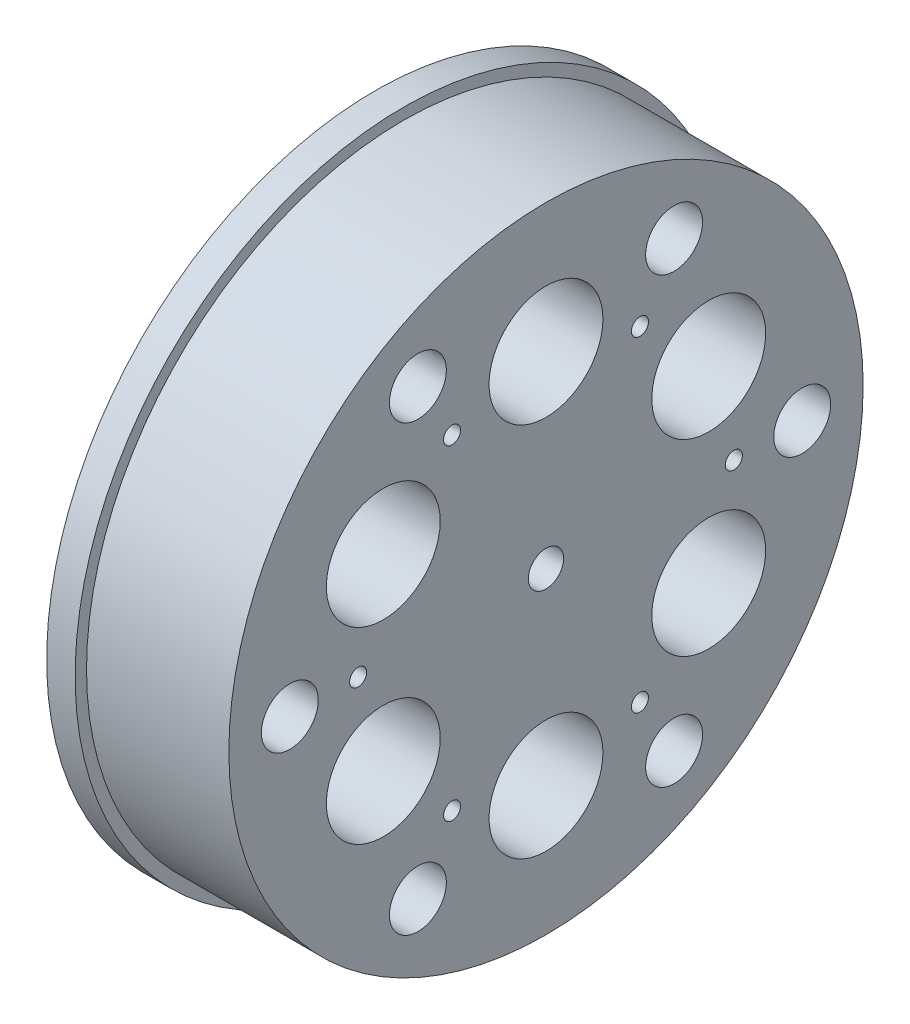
ISO-10303-21;
HEADER;
FILE_DESCRIPTION(('STEP AP214'),'2;1');
FILE_NAME('part.step','',(''),(''),'','','');
FILE_SCHEMA(('AUTOMOTIVE_DESIGN { 1 0 10303 214 1 1 1 1 }'));
ENDSEC;
DATA;
#1=APPLICATION_CONTEXT('core data for automotive mechanical design processes');
#2=APPLICATION_PROTOCOL_DEFINITION('international standard','automotive_design',2000,#1);
#3=PRODUCT_CONTEXT('',#1,'mechanical');
#4=PRODUCT('Part','Part','',(#3));
#5=PRODUCT_RELATED_PRODUCT_CATEGORY('part','',(#4));
#6=PRODUCT_DEFINITION_FORMATION('','',#4);
#7=PRODUCT_DEFINITION_CONTEXT('part definition',#1,'design');
#8=PRODUCT_DEFINITION('design','',#6,#7);
#9=PRODUCT_DEFINITION_SHAPE('','',#8);
#10=(LENGTH_UNIT() NAMED_UNIT(*) SI_UNIT(.MILLI.,.METRE.));
#11=(NAMED_UNIT(*) PLANE_ANGLE_UNIT() SI_UNIT($,.RADIAN.));
#12=(NAMED_UNIT(*) SI_UNIT($,.STERADIAN.) SOLID_ANGLE_UNIT());
#13=UNCERTAINTY_MEASURE_WITH_UNIT(LENGTH_MEASURE(1.E-05),#10,'distance_accuracy_value','');
#14=(GEOMETRIC_REPRESENTATION_CONTEXT(3) GLOBAL_UNCERTAINTY_ASSIGNED_CONTEXT((#13)) GLOBAL_UNIT_ASSIGNED_CONTEXT((#10,
#11,#12)) REPRESENTATION_CONTEXT('',''));
#15=CARTESIAN_POINT('',(0.,0.,0.));
#16=DIRECTION('',(0.,0.,1.));
#17=DIRECTION('',(1.,0.,0.));
#18=AXIS2_PLACEMENT_3D('',#15,#16,#17);
#19=CARTESIAN_POINT('',(30.,0.,0.));
#20=DIRECTION('',(1.,0.,0.));
#21=DIRECTION('',(0.,0.,-1.));
#22=AXIS2_PLACEMENT_3D('',#19,#20,#21);
#23=PLANE('',#22);
#24=CARTESIAN_POINT('',(30.,28.5788383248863,-16.5000000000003));
#25=DIRECTION('',(1.,0.,0.));
#26=DIRECTION('',(0.,0.,-1.));
#27=AXIS2_PLACEMENT_3D('',#24,#25,#26);
#28=CIRCLE('',#27,1.50000000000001);
#29=CARTESIAN_POINT('',(30.,28.5788383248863,-18.0000000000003));
#30=VERTEX_POINT('',#29);
#31=EDGE_CURVE('E154',#30,#30,#28,.T.);
#32=ORIENTED_EDGE('',*,*,#31,.F.);
#33=EDGE_LOOP('',(#32));
#34=FACE_BOUND('',#33,.T.);
#35=CARTESIAN_POINT('',(30.,28.5788383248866,16.4999999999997));
#36=DIRECTION('',(1.,0.,0.));
#37=DIRECTION('',(0.,0.,-1.));
#38=AXIS2_PLACEMENT_3D('',#35,#36,#37);
#39=CIRCLE('',#38,1.5);
#40=CARTESIAN_POINT('',(30.,28.5788383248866,14.9999999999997));
#41=VERTEX_POINT('',#40);
#42=EDGE_CURVE('E142',#41,#41,#39,.T.);
#43=ORIENTED_EDGE('',*,*,#42,.F.);
#44=EDGE_LOOP('',(#43));
#45=FACE_BOUND('',#44,.T.);
#46=CARTESIAN_POINT('',(30.,2.41717601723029E-13,33.));
#47=DIRECTION('',(1.,0.,0.));
#48=DIRECTION('',(0.,0.,-1.));
#49=AXIS2_PLACEMENT_3D('',#46,#47,#48);
#50=CIRCLE('',#49,1.5);
#51=CARTESIAN_POINT('',(30.,2.41717601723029E-13,31.5));
#52=VERTEX_POINT('',#51);
#53=EDGE_CURVE('E130',#52,#52,#50,.T.);
#54=ORIENTED_EDGE('',*,*,#53,.F.);
#55=EDGE_LOOP('',(#54));
#56=FACE_BOUND('',#55,.T.);
#57=CARTESIAN_POINT('',(30.,-28.5788383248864,16.5000000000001));
#58=DIRECTION('',(1.,0.,0.));
#59=DIRECTION('',(0.,0.,-1.));
#60=AXIS2_PLACEMENT_3D('',#57,#58,#59);
#61=CIRCLE('',#60,1.50000000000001);
#62=CARTESIAN_POINT('',(30.,-28.5788383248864,15.0000000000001));
#63=VERTEX_POINT('',#62);
#64=EDGE_CURVE('E118',#63,#63,#61,.T.);
#65=ORIENTED_EDGE('',*,*,#64,.F.);
#66=EDGE_LOOP('',(#65));
#67=FACE_BOUND('',#66,.T.);
#68=CARTESIAN_POINT('',(30.,-28.5788383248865,-16.4999999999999));
#69=DIRECTION('',(1.,0.,0.));
#70=DIRECTION('',(0.,0.,-1.));
#71=AXIS2_PLACEMENT_3D('',#68,#69,#70);
#72=CIRCLE('',#71,1.5);
#73=CARTESIAN_POINT('',(30.,-28.5788383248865,-17.9999999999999));
#74=VERTEX_POINT('',#73);
#75=EDGE_CURVE('E106',#74,#74,#72,.T.);
#76=ORIENTED_EDGE('',*,*,#75,.F.);
#77=EDGE_LOOP('',(#76));
#78=FACE_BOUND('',#77,.T.);
#79=CARTESIAN_POINT('',(30.,38.9711431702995,-22.5000000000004));
#80=DIRECTION('',(1.,0.,0.));
#81=DIRECTION('',(0.,0.,-1.));
#82=AXIS2_PLACEMENT_3D('',#79,#80,#81);
#83=CIRCLE('',#82,5.);
#84=CARTESIAN_POINT('',(30.,38.9711431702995,-27.5000000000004));
#85=VERTEX_POINT('',#84);
#86=EDGE_CURVE('E94',#85,#85,#83,.T.);
#87=ORIENTED_EDGE('',*,*,#86,.F.);
#88=EDGE_LOOP('',(#87));
#89=FACE_BOUND('',#88,.T.);
#90=CARTESIAN_POINT('',(30.,3.14233502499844E-13,45.));
#91=DIRECTION('',(1.,0.,0.));
#92=DIRECTION('',(0.,0.,-1.));
#93=AXIS2_PLACEMENT_3D('',#90,#91,#92);
#94=CIRCLE('',#93,5.);
#95=CARTESIAN_POINT('',(30.,3.14233502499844E-13,40.));
#96=VERTEX_POINT('',#95);
#97=EDGE_CURVE('E82',#96,#96,#94,.T.);
#98=ORIENTED_EDGE('',*,*,#97,.F.);
#99=EDGE_LOOP('',(#98));
#100=FACE_BOUND('',#99,.T.);
#101=CARTESIAN_POINT('',(30.,0.,-33.));
#102=DIRECTION('',(1.,0.,0.));
#103=DIRECTION('',(0.,0.,-1.));
#104=AXIS2_PLACEMENT_3D('',#101,#102,#103);
#105=CIRCLE('',#104,1.5);
#106=CARTESIAN_POINT('',(30.,0.,-34.5));
#107=VERTEX_POINT('',#106);
#108=EDGE_CURVE('E70',#107,#107,#105,.T.);
#109=ORIENTED_EDGE('',*,*,#108,.F.);
#110=EDGE_LOOP('',(#109));
#111=FACE_BOUND('',#110,.T.);
#112=CARTESIAN_POINT('',(30.,0.,-45.));
#113=DIRECTION('',(1.,0.,0.));
#114=DIRECTION('',(0.,0.,-1.));
#115=AXIS2_PLACEMENT_3D('',#112,#113,#114);
#116=CIRCLE('',#115,5.);
#117=CARTESIAN_POINT('',(30.,0.,-50.));
#118=VERTEX_POINT('',#117);
#119=EDGE_CURVE('E58',#118,#118,#116,.T.);
#120=ORIENTED_EDGE('',*,*,#119,.F.);
#121=EDGE_LOOP('',(#120));
#122=FACE_BOUND('',#121,.T.);
#123=CARTESIAN_POINT('',(30.,33.,0.));
#124=DIRECTION('',(1.,0.,0.));
#125=DIRECTION('',(0.,0.,-1.));
#126=AXIS2_PLACEMENT_3D('',#123,#124,#125);
#127=CIRCLE('',#126,10.);
#128=CARTESIAN_POINT('',(30.,33.,-10.));
#129=VERTEX_POINT('',#128);
#130=EDGE_CURVE('E45',#129,#129,#127,.T.);
#131=ORIENTED_EDGE('',*,*,#130,.F.);
#132=EDGE_LOOP('',(#131));
#133=FACE_BOUND('',#132,.T.);
#134=CARTESIAN_POINT('',(30.,0.,0.));
#135=DIRECTION('',(1.,0.,0.));
#136=DIRECTION('',(0.,0.,-1.));
#137=AXIS2_PLACEMENT_3D('',#134,#135,#136);
#138=CIRCLE('',#137,3.1);
#139=CARTESIAN_POINT('',(30.,0.,-3.1));
#140=VERTEX_POINT('',#139);
#141=EDGE_CURVE('E53',#140,#140,#138,.T.);
#142=ORIENTED_EDGE('',*,*,#141,.F.);
#143=EDGE_LOOP('',(#142));
#144=FACE_BOUND('',#143,.T.);
#145=CARTESIAN_POINT('',(30.,-38.9711431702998,-22.4999999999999));
#146=DIRECTION('',(1.,0.,0.));
#147=DIRECTION('',(0.,0.,-1.));
#148=AXIS2_PLACEMENT_3D('',#145,#146,#147);
#149=CIRCLE('',#148,5.);
#150=CARTESIAN_POINT('',(30.,-38.9711431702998,-27.4999999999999));
#151=VERTEX_POINT('',#150);
#152=EDGE_CURVE('E64',#151,#151,#149,.T.);
#153=ORIENTED_EDGE('',*,*,#152,.F.);
#154=EDGE_LOOP('',(#153));
#155=FACE_BOUND('',#154,.T.);
#156=CARTESIAN_POINT('',(30.,-38.9711431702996,22.5000000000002));
#157=DIRECTION('',(1.,0.,0.));
#158=DIRECTION('',(0.,0.,-1.));
#159=AXIS2_PLACEMENT_3D('',#156,#157,#158);
#160=CIRCLE('',#159,5.);
#161=CARTESIAN_POINT('',(30.,-38.9711431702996,17.5000000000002));
#162=VERTEX_POINT('',#161);
#163=EDGE_CURVE('E76',#162,#162,#160,.T.);
#164=ORIENTED_EDGE('',*,*,#163,.F.);
#165=EDGE_LOOP('',(#164));
#166=FACE_BOUND('',#165,.T.);
#167=CARTESIAN_POINT('',(30.,38.9711431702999,22.4999999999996));
#168=DIRECTION('',(1.,0.,0.));
#169=DIRECTION('',(0.,0.,-1.));
#170=AXIS2_PLACEMENT_3D('',#167,#168,#169);
#171=CIRCLE('',#170,5.);
#172=CARTESIAN_POINT('',(30.,38.9711431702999,17.4999999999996));
#173=VERTEX_POINT('',#172);
#174=EDGE_CURVE('E88',#173,#173,#171,.T.);
#175=ORIENTED_EDGE('',*,*,#174,.F.);
#176=EDGE_LOOP('',(#175));
#177=FACE_BOUND('',#176,.T.);
#178=CARTESIAN_POINT('',(30.,16.4999999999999,-28.5788383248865));
#179=DIRECTION('',(1.,0.,0.));
#180=DIRECTION('',(0.,0.,-1.));
#181=AXIS2_PLACEMENT_3D('',#178,#179,#180);
#182=CIRCLE('',#181,10.);
#183=CARTESIAN_POINT('',(30.,16.4999999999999,-38.5788383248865));
#184=VERTEX_POINT('',#183);
#185=EDGE_CURVE('E100',#184,#184,#182,.T.);
#186=ORIENTED_EDGE('',*,*,#185,.F.);
#187=EDGE_LOOP('',(#186));
#188=FACE_BOUND('',#187,.T.);
#189=CARTESIAN_POINT('',(30.,-16.5000000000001,-28.5788383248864));
#190=DIRECTION('',(1.,0.,0.));
#191=DIRECTION('',(0.,0.,-1.));
#192=AXIS2_PLACEMENT_3D('',#189,#190,#191);
#193=CIRCLE('',#192,10.);
#194=CARTESIAN_POINT('',(30.,-16.5000000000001,-38.5788383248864));
#195=VERTEX_POINT('',#194);
#196=EDGE_CURVE('E112',#195,#195,#193,.T.);
#197=ORIENTED_EDGE('',*,*,#196,.F.);
#198=EDGE_LOOP('',(#197));
#199=FACE_BOUND('',#198,.T.);
#200=CARTESIAN_POINT('',(30.,-33.,2.30437901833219E-13));
#201=DIRECTION('',(1.,0.,0.));
#202=DIRECTION('',(0.,0.,-1.));
#203=AXIS2_PLACEMENT_3D('',#200,#201,#202);
#204=CIRCLE('',#203,10.);
#205=CARTESIAN_POINT('',(30.,-33.,-9.99999999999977));
#206=VERTEX_POINT('',#205);
#207=EDGE_CURVE('E124',#206,#206,#204,.T.);
#208=ORIENTED_EDGE('',*,*,#207,.F.);
#209=EDGE_LOOP('',(#208));
#210=FACE_BOUND('',#209,.T.);
#211=CARTESIAN_POINT('',(30.,-16.4999999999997,28.5788383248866));
#212=DIRECTION('',(1.,0.,0.));
#213=DIRECTION('',(0.,0.,-1.));
#214=AXIS2_PLACEMENT_3D('',#211,#212,#213);
#215=CIRCLE('',#214,10.);
#216=CARTESIAN_POINT('',(30.,-16.4999999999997,18.5788383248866));
#217=VERTEX_POINT('',#216);
#218=EDGE_CURVE('E136',#217,#217,#215,.T.);
#219=ORIENTED_EDGE('',*,*,#218,.F.);
#220=EDGE_LOOP('',(#219));
#221=FACE_BOUND('',#220,.T.);
#222=CARTESIAN_POINT('',(30.,16.5000000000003,28.5788383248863));
#223=DIRECTION('',(1.,0.,0.));
#224=DIRECTION('',(0.,0.,-1.));
#225=AXIS2_PLACEMENT_3D('',#222,#223,#224);
#226=CIRCLE('',#225,10.);
#227=CARTESIAN_POINT('',(30.,16.5000000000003,18.5788383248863));
#228=VERTEX_POINT('',#227);
#229=EDGE_CURVE('E148',#228,#228,#226,.T.);
#230=ORIENTED_EDGE('',*,*,#229,.F.);
#231=EDGE_LOOP('',(#230));
#232=FACE_BOUND('',#231,.T.);
#233=CARTESIAN_POINT('',(30.,0.,0.));
#234=DIRECTION('',(1.,0.,0.));
#235=DIRECTION('',(0.,0.,-1.));
#236=AXIS2_PLACEMENT_3D('',#233,#234,#235);
#237=CIRCLE('',#236,55.705);
#238=CARTESIAN_POINT('',(30.,0.,-55.705));
#239=VERTEX_POINT('',#238);
#240=EDGE_CURVE('E162',#239,#239,#237,.T.);
#241=ORIENTED_EDGE('',*,*,#240,.T.);
#242=EDGE_LOOP('',(#241));
#243=FACE_BOUND('',#242,.T.);
#244=ADVANCED_FACE('F37',(#34,#45,#56,#67,#78,#89,#100,#111,#122,#133,#144,#155,#166,#177,#188,
#199,#210,#221,#232,#243),#23,.T.);
#245=CARTESIAN_POINT('',(30.,0.,0.));
#246=DIRECTION('',(-1.,0.,0.));
#247=DIRECTION('',(0.,0.,1.));
#248=AXIS2_PLACEMENT_3D('',#245,#246,#247);
#249=CYLINDRICAL_SURFACE('',#248,57.705);
#250=CARTESIAN_POINT('',(0.,0.,0.));
#251=DIRECTION('',(1.,0.,0.));
#252=DIRECTION('',(0.,0.,-1.));
#253=AXIS2_PLACEMENT_3D('',#250,#251,#252);
#254=CIRCLE('',#253,57.705);
#255=CARTESIAN_POINT('',(0.,0.,-57.705));
#256=VERTEX_POINT('',#255);
#257=EDGE_CURVE('E10',#256,#256,#254,.T.);
#258=ORIENTED_EDGE('',*,*,#257,.T.);
#259=EDGE_LOOP('',(#258));
#260=FACE_BOUND('',#259,.T.);
#261=CARTESIAN_POINT('',(5.,0.,0.));
#262=DIRECTION('',(1.,0.,0.));
#263=DIRECTION('',(0.,0.,-1.));
#264=AXIS2_PLACEMENT_3D('',#261,#262,#263);
#265=CIRCLE('',#264,57.705);
#266=CARTESIAN_POINT('',(5.,0.,-57.705));
#267=VERTEX_POINT('',#266);
#268=EDGE_CURVE('E41',#267,#267,#265,.T.);
#269=ORIENTED_EDGE('',*,*,#268,.F.);
#270=EDGE_LOOP('',(#269));
#271=FACE_BOUND('',#270,.T.);
#272=ADVANCED_FACE('F39',(#260,#271),#249,.T.);
#273=CARTESIAN_POINT('',(0.,0.,0.));
#274=DIRECTION('',(1.,0.,0.));
#275=DIRECTION('',(0.,0.,-1.));
#276=AXIS2_PLACEMENT_3D('',#273,#274,#275);
#277=PLANE('',#276);
#278=CARTESIAN_POINT('',(0.,16.5000000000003,28.5788383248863));
#279=DIRECTION('',(1.,0.,0.));
#280=DIRECTION('',(0.,0.,-1.));
#281=AXIS2_PLACEMENT_3D('',#278,#279,#280);
#282=CIRCLE('',#281,10.);
#283=CARTESIAN_POINT('',(0.,16.5000000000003,18.5788383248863));
#284=VERTEX_POINT('',#283);
#285=EDGE_CURVE('E151',#284,#284,#282,.T.);
#286=ORIENTED_EDGE('',*,*,#285,.T.);
#287=EDGE_LOOP('',(#286));
#288=FACE_BOUND('',#287,.T.);
#289=CARTESIAN_POINT('',(0.,-16.4999999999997,28.5788383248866));
#290=DIRECTION('',(1.,0.,0.));
#291=DIRECTION('',(0.,0.,-1.));
#292=AXIS2_PLACEMENT_3D('',#289,#290,#291);
#293=CIRCLE('',#292,10.);
#294=CARTESIAN_POINT('',(0.,-16.4999999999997,18.5788383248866));
#295=VERTEX_POINT('',#294);
#296=EDGE_CURVE('E139',#295,#295,#293,.T.);
#297=ORIENTED_EDGE('',*,*,#296,.T.);
#298=EDGE_LOOP('',(#297));
#299=FACE_BOUND('',#298,.T.);
#300=CARTESIAN_POINT('',(0.,-33.,2.30437901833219E-13));
#301=DIRECTION('',(1.,0.,0.));
#302=DIRECTION('',(0.,0.,-1.));
#303=AXIS2_PLACEMENT_3D('',#300,#301,#302);
#304=CIRCLE('',#303,10.);
#305=CARTESIAN_POINT('',(0.,-33.,-9.99999999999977));
#306=VERTEX_POINT('',#305);
#307=EDGE_CURVE('E127',#306,#306,#304,.T.);
#308=ORIENTED_EDGE('',*,*,#307,.T.);
#309=EDGE_LOOP('',(#308));
#310=FACE_BOUND('',#309,.T.);
#311=CARTESIAN_POINT('',(0.,-16.5000000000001,-28.5788383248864));
#312=DIRECTION('',(1.,0.,0.));
#313=DIRECTION('',(0.,0.,-1.));
#314=AXIS2_PLACEMENT_3D('',#311,#312,#313);
#315=CIRCLE('',#314,10.);
#316=CARTESIAN_POINT('',(0.,-16.5000000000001,-38.5788383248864));
#317=VERTEX_POINT('',#316);
#318=EDGE_CURVE('E115',#317,#317,#315,.T.);
#319=ORIENTED_EDGE('',*,*,#318,.T.);
#320=EDGE_LOOP('',(#319));
#321=FACE_BOUND('',#320,.T.);
#322=CARTESIAN_POINT('',(0.,16.4999999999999,-28.5788383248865));
#323=DIRECTION('',(1.,0.,0.));
#324=DIRECTION('',(0.,0.,-1.));
#325=AXIS2_PLACEMENT_3D('',#322,#323,#324);
#326=CIRCLE('',#325,10.);
#327=CARTESIAN_POINT('',(0.,16.4999999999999,-38.5788383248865));
#328=VERTEX_POINT('',#327);
#329=EDGE_CURVE('E103',#328,#328,#326,.T.);
#330=ORIENTED_EDGE('',*,*,#329,.T.);
#331=EDGE_LOOP('',(#330));
#332=FACE_BOUND('',#331,.T.);
#333=CARTESIAN_POINT('',(0.,38.9711431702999,22.4999999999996));
#334=DIRECTION('',(1.,0.,0.));
#335=DIRECTION('',(0.,0.,-1.));
#336=AXIS2_PLACEMENT_3D('',#333,#334,#335);
#337=CIRCLE('',#336,5.);
#338=CARTESIAN_POINT('',(0.,38.9711431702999,17.4999999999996));
#339=VERTEX_POINT('',#338);
#340=EDGE_CURVE('E91',#339,#339,#337,.T.);
#341=ORIENTED_EDGE('',*,*,#340,.T.);
#342=EDGE_LOOP('',(#341));
#343=FACE_BOUND('',#342,.T.);
#344=CARTESIAN_POINT('',(0.,-38.9711431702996,22.5000000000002));
#345=DIRECTION('',(1.,0.,0.));
#346=DIRECTION('',(0.,0.,-1.));
#347=AXIS2_PLACEMENT_3D('',#344,#345,#346);
#348=CIRCLE('',#347,5.);
#349=CARTESIAN_POINT('',(0.,-38.9711431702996,17.5000000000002));
#350=VERTEX_POINT('',#349);
#351=EDGE_CURVE('E79',#350,#350,#348,.T.);
#352=ORIENTED_EDGE('',*,*,#351,.T.);
#353=EDGE_LOOP('',(#352));
#354=FACE_BOUND('',#353,.T.);
#355=CARTESIAN_POINT('',(0.,-38.9711431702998,-22.4999999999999));
#356=DIRECTION('',(1.,0.,0.));
#357=DIRECTION('',(0.,0.,-1.));
#358=AXIS2_PLACEMENT_3D('',#355,#356,#357);
#359=CIRCLE('',#358,5.);
#360=CARTESIAN_POINT('',(0.,-38.9711431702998,-27.4999999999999));
#361=VERTEX_POINT('',#360);
#362=EDGE_CURVE('E67',#361,#361,#359,.T.);
#363=ORIENTED_EDGE('',*,*,#362,.T.);
#364=EDGE_LOOP('',(#363));
#365=FACE_BOUND('',#364,.T.);
#366=CARTESIAN_POINT('',(0.,0.,0.));
#367=DIRECTION('',(1.,0.,0.));
#368=DIRECTION('',(0.,0.,-1.));
#369=AXIS2_PLACEMENT_3D('',#366,#367,#368);
#370=CIRCLE('',#369,3.1);
#371=CARTESIAN_POINT('',(0.,0.,-3.1));
#372=VERTEX_POINT('',#371);
#373=EDGE_CURVE('E55',#372,#372,#370,.T.);
#374=ORIENTED_EDGE('',*,*,#373,.T.);
#375=EDGE_LOOP('',(#374));
#376=FACE_BOUND('',#375,.T.);
#377=ORIENTED_EDGE('',*,*,#257,.F.);
#378=EDGE_LOOP('',(#377));
#379=FACE_BOUND('',#378,.T.);
#380=CARTESIAN_POINT('',(0.,33.,0.));
#381=DIRECTION('',(1.,0.,0.));
#382=DIRECTION('',(0.,0.,-1.));
#383=AXIS2_PLACEMENT_3D('',#380,#381,#382);
#384=CIRCLE('',#383,10.);
#385=CARTESIAN_POINT('',(0.,33.,-10.));
#386=VERTEX_POINT('',#385);
#387=EDGE_CURVE('E49',#386,#386,#384,.T.);
#388=ORIENTED_EDGE('',*,*,#387,.T.);
#389=EDGE_LOOP('',(#388));
#390=FACE_BOUND('',#389,.T.);
#391=CARTESIAN_POINT('',(0.,0.,-45.));
#392=DIRECTION('',(1.,0.,0.));
#393=DIRECTION('',(0.,0.,-1.));
#394=AXIS2_PLACEMENT_3D('',#391,#392,#393);
#395=CIRCLE('',#394,5.);
#396=CARTESIAN_POINT('',(0.,0.,-50.));
#397=VERTEX_POINT('',#396);
#398=EDGE_CURVE('E61',#397,#397,#395,.T.);
#399=ORIENTED_EDGE('',*,*,#398,.T.);
#400=EDGE_LOOP('',(#399));
#401=FACE_BOUND('',#400,.T.);
#402=CARTESIAN_POINT('',(0.,0.,-33.));
#403=DIRECTION('',(1.,0.,0.));
#404=DIRECTION('',(0.,0.,-1.));
#405=AXIS2_PLACEMENT_3D('',#402,#403,#404);
#406=CIRCLE('',#405,1.5);
#407=CARTESIAN_POINT('',(0.,0.,-34.5));
#408=VERTEX_POINT('',#407);
#409=EDGE_CURVE('E73',#408,#408,#406,.T.);
#410=ORIENTED_EDGE('',*,*,#409,.T.);
#411=EDGE_LOOP('',(#410));
#412=FACE_BOUND('',#411,.T.);
#413=CARTESIAN_POINT('',(0.,3.14233502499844E-13,45.));
#414=DIRECTION('',(1.,0.,0.));
#415=DIRECTION('',(0.,0.,-1.));
#416=AXIS2_PLACEMENT_3D('',#413,#414,#415);
#417=CIRCLE('',#416,5.);
#418=CARTESIAN_POINT('',(0.,3.14233502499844E-13,40.));
#419=VERTEX_POINT('',#418);
#420=EDGE_CURVE('E85',#419,#419,#417,.T.);
#421=ORIENTED_EDGE('',*,*,#420,.T.);
#422=EDGE_LOOP('',(#421));
#423=FACE_BOUND('',#422,.T.);
#424=CARTESIAN_POINT('',(0.,38.9711431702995,-22.5000000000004));
#425=DIRECTION('',(1.,0.,0.));
#426=DIRECTION('',(0.,0.,-1.));
#427=AXIS2_PLACEMENT_3D('',#424,#425,#426);
#428=CIRCLE('',#427,5.);
#429=CARTESIAN_POINT('',(0.,38.9711431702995,-27.5000000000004));
#430=VERTEX_POINT('',#429);
#431=EDGE_CURVE('E97',#430,#430,#428,.T.);
#432=ORIENTED_EDGE('',*,*,#431,.T.);
#433=EDGE_LOOP('',(#432));
#434=FACE_BOUND('',#433,.T.);
#435=CARTESIAN_POINT('',(0.,-28.5788383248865,-16.4999999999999));
#436=DIRECTION('',(1.,0.,0.));
#437=DIRECTION('',(0.,0.,-1.));
#438=AXIS2_PLACEMENT_3D('',#435,#436,#437);
#439=CIRCLE('',#438,1.5);
#440=CARTESIAN_POINT('',(0.,-28.5788383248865,-17.9999999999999));
#441=VERTEX_POINT('',#440);
#442=EDGE_CURVE('E109',#441,#441,#439,.T.);
#443=ORIENTED_EDGE('',*,*,#442,.T.);
#444=EDGE_LOOP('',(#443));
#445=FACE_BOUND('',#444,.T.);
#446=CARTESIAN_POINT('',(0.,-28.5788383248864,16.5000000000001));
#447=DIRECTION('',(1.,0.,0.));
#448=DIRECTION('',(0.,0.,-1.));
#449=AXIS2_PLACEMENT_3D('',#446,#447,#448);
#450=CIRCLE('',#449,1.50000000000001);
#451=CARTESIAN_POINT('',(0.,-28.5788383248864,15.0000000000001));
#452=VERTEX_POINT('',#451);
#453=EDGE_CURVE('E121',#452,#452,#450,.T.);
#454=ORIENTED_EDGE('',*,*,#453,.T.);
#455=EDGE_LOOP('',(#454));
#456=FACE_BOUND('',#455,.T.);
#457=CARTESIAN_POINT('',(0.,2.41717601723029E-13,33.));
#458=DIRECTION('',(1.,0.,0.));
#459=DIRECTION('',(0.,0.,-1.));
#460=AXIS2_PLACEMENT_3D('',#457,#458,#459);
#461=CIRCLE('',#460,1.5);
#462=CARTESIAN_POINT('',(0.,2.41717601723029E-13,31.5));
#463=VERTEX_POINT('',#462);
#464=EDGE_CURVE('E133',#463,#463,#461,.T.);
#465=ORIENTED_EDGE('',*,*,#464,.T.);
#466=EDGE_LOOP('',(#465));
#467=FACE_BOUND('',#466,.T.);
#468=CARTESIAN_POINT('',(0.,28.5788383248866,16.4999999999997));
#469=DIRECTION('',(1.,0.,0.));
#470=DIRECTION('',(0.,0.,-1.));
#471=AXIS2_PLACEMENT_3D('',#468,#469,#470);
#472=CIRCLE('',#471,1.5);
#473=CARTESIAN_POINT('',(0.,28.5788383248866,14.9999999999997));
#474=VERTEX_POINT('',#473);
#475=EDGE_CURVE('E145',#474,#474,#472,.T.);
#476=ORIENTED_EDGE('',*,*,#475,.T.);
#477=EDGE_LOOP('',(#476));
#478=FACE_BOUND('',#477,.T.);
#479=CARTESIAN_POINT('',(0.,28.5788383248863,-16.5000000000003));
#480=DIRECTION('',(1.,0.,0.));
#481=DIRECTION('',(0.,0.,-1.));
#482=AXIS2_PLACEMENT_3D('',#479,#480,#481);
#483=CIRCLE('',#482,1.50000000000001);
#484=CARTESIAN_POINT('',(0.,28.5788383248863,-18.0000000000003));
#485=VERTEX_POINT('',#484);
#486=EDGE_CURVE('E157',#485,#485,#483,.T.);
#487=ORIENTED_EDGE('',*,*,#486,.T.);
#488=EDGE_LOOP('',(#487));
#489=FACE_BOUND('',#488,.T.);
#490=ADVANCED_FACE('F175',(#288,#299,#310,#321,#332,#343,#354,#365,#376,#379,#390,#401,#412,
#423,#434,#445,#456,#467,#478,#489),#277,.F.);
#491=CARTESIAN_POINT('',(30.,33.,0.));
#492=DIRECTION('',(-1.,0.,0.));
#493=DIRECTION('',(0.,0.,1.));
#494=AXIS2_PLACEMENT_3D('',#491,#492,#493);
#495=CYLINDRICAL_SURFACE('',#494,10.);
#496=ORIENTED_EDGE('',*,*,#130,.T.);
#497=EDGE_LOOP('',(#496));
#498=FACE_BOUND('',#497,.T.);
#499=ORIENTED_EDGE('',*,*,#387,.F.);
#500=EDGE_LOOP('',(#499));
#501=FACE_BOUND('',#500,.T.);
#502=ADVANCED_FACE('F180',(#498,#501),#495,.F.);
#503=CARTESIAN_POINT('',(30.,0.,0.));
#504=DIRECTION('',(-1.,0.,0.));
#505=DIRECTION('',(0.,0.,1.));
#506=AXIS2_PLACEMENT_3D('',#503,#504,#505);
#507=CYLINDRICAL_SURFACE('',#506,3.1);
#508=ORIENTED_EDGE('',*,*,#141,.T.);
#509=EDGE_LOOP('',(#508));
#510=FACE_BOUND('',#509,.T.);
#511=ORIENTED_EDGE('',*,*,#373,.F.);
#512=EDGE_LOOP('',(#511));
#513=FACE_BOUND('',#512,.T.);
#514=ADVANCED_FACE('F191',(#510,#513),#507,.F.);
#515=CARTESIAN_POINT('',(30.,0.,-45.));
#516=DIRECTION('',(-1.,0.,0.));
#517=DIRECTION('',(0.,0.,1.));
#518=AXIS2_PLACEMENT_3D('',#515,#516,#517);
#519=CYLINDRICAL_SURFACE('',#518,5.);
#520=ORIENTED_EDGE('',*,*,#119,.T.);
#521=EDGE_LOOP('',(#520));
#522=FACE_BOUND('',#521,.T.);
#523=ORIENTED_EDGE('',*,*,#398,.F.);
#524=EDGE_LOOP('',(#523));
#525=FACE_BOUND('',#524,.T.);
#526=ADVANCED_FACE('F195',(#522,#525),#519,.F.);
#527=CARTESIAN_POINT('',(30.,-38.9711431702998,-22.4999999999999));
#528=DIRECTION('',(-1.,0.,0.));
#529=DIRECTION('',(0.,0.,1.));
#530=AXIS2_PLACEMENT_3D('',#527,#528,#529);
#531=CYLINDRICAL_SURFACE('',#530,5.);
#532=ORIENTED_EDGE('',*,*,#152,.T.);
#533=EDGE_LOOP('',(#532));
#534=FACE_BOUND('',#533,.T.);
#535=ORIENTED_EDGE('',*,*,#362,.F.);
#536=EDGE_LOOP('',(#535));
#537=FACE_BOUND('',#536,.T.);
#538=ADVANCED_FACE('F199',(#534,#537),#531,.F.);
#539=CARTESIAN_POINT('',(30.,0.,-33.));
#540=DIRECTION('',(-1.,0.,0.));
#541=DIRECTION('',(0.,0.,1.));
#542=AXIS2_PLACEMENT_3D('',#539,#540,#541);
#543=CYLINDRICAL_SURFACE('',#542,1.5);
#544=ORIENTED_EDGE('',*,*,#108,.T.);
#545=EDGE_LOOP('',(#544));
#546=FACE_BOUND('',#545,.T.);
#547=ORIENTED_EDGE('',*,*,#409,.F.);
#548=EDGE_LOOP('',(#547));
#549=FACE_BOUND('',#548,.T.);
#550=ADVANCED_FACE('F203',(#546,#549),#543,.F.);
#551=CARTESIAN_POINT('',(30.,-38.9711431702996,22.5000000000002));
#552=DIRECTION('',(-1.,0.,0.));
#553=DIRECTION('',(0.,0.,1.));
#554=AXIS2_PLACEMENT_3D('',#551,#552,#553);
#555=CYLINDRICAL_SURFACE('',#554,5.);
#556=ORIENTED_EDGE('',*,*,#163,.T.);
#557=EDGE_LOOP('',(#556));
#558=FACE_BOUND('',#557,.T.);
#559=ORIENTED_EDGE('',*,*,#351,.F.);
#560=EDGE_LOOP('',(#559));
#561=FACE_BOUND('',#560,.T.);
#562=ADVANCED_FACE('F207',(#558,#561),#555,.F.);
#563=CARTESIAN_POINT('',(30.,3.14233502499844E-13,45.));
#564=DIRECTION('',(-1.,0.,0.));
#565=DIRECTION('',(0.,0.,1.));
#566=AXIS2_PLACEMENT_3D('',#563,#564,#565);
#567=CYLINDRICAL_SURFACE('',#566,5.);
#568=ORIENTED_EDGE('',*,*,#97,.T.);
#569=EDGE_LOOP('',(#568));
#570=FACE_BOUND('',#569,.T.);
#571=ORIENTED_EDGE('',*,*,#420,.F.);
#572=EDGE_LOOP('',(#571));
#573=FACE_BOUND('',#572,.T.);
#574=ADVANCED_FACE('F211',(#570,#573),#567,.F.);
#575=CARTESIAN_POINT('',(30.,38.9711431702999,22.4999999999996));
#576=DIRECTION('',(-1.,0.,0.));
#577=DIRECTION('',(0.,0.,1.));
#578=AXIS2_PLACEMENT_3D('',#575,#576,#577);
#579=CYLINDRICAL_SURFACE('',#578,5.);
#580=ORIENTED_EDGE('',*,*,#174,.T.);
#581=EDGE_LOOP('',(#580));
#582=FACE_BOUND('',#581,.T.);
#583=ORIENTED_EDGE('',*,*,#340,.F.);
#584=EDGE_LOOP('',(#583));
#585=FACE_BOUND('',#584,.T.);
#586=ADVANCED_FACE('F215',(#582,#585),#579,.F.);
#587=CARTESIAN_POINT('',(30.,38.9711431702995,-22.5000000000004));
#588=DIRECTION('',(-1.,0.,0.));
#589=DIRECTION('',(0.,0.,1.));
#590=AXIS2_PLACEMENT_3D('',#587,#588,#589);
#591=CYLINDRICAL_SURFACE('',#590,5.);
#592=ORIENTED_EDGE('',*,*,#86,.T.);
#593=EDGE_LOOP('',(#592));
#594=FACE_BOUND('',#593,.T.);
#595=ORIENTED_EDGE('',*,*,#431,.F.);
#596=EDGE_LOOP('',(#595));
#597=FACE_BOUND('',#596,.T.);
#598=ADVANCED_FACE('F219',(#594,#597),#591,.F.);
#599=CARTESIAN_POINT('',(30.,16.4999999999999,-28.5788383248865));
#600=DIRECTION('',(-1.,0.,0.));
#601=DIRECTION('',(0.,0.,1.));
#602=AXIS2_PLACEMENT_3D('',#599,#600,#601);
#603=CYLINDRICAL_SURFACE('',#602,10.);
#604=ORIENTED_EDGE('',*,*,#185,.T.);
#605=EDGE_LOOP('',(#604));
#606=FACE_BOUND('',#605,.T.);
#607=ORIENTED_EDGE('',*,*,#329,.F.);
#608=EDGE_LOOP('',(#607));
#609=FACE_BOUND('',#608,.T.);
#610=ADVANCED_FACE('F223',(#606,#609),#603,.F.);
#611=CARTESIAN_POINT('',(30.,-28.5788383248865,-16.4999999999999));
#612=DIRECTION('',(-1.,0.,0.));
#613=DIRECTION('',(0.,0.,1.));
#614=AXIS2_PLACEMENT_3D('',#611,#612,#613);
#615=CYLINDRICAL_SURFACE('',#614,1.5);
#616=ORIENTED_EDGE('',*,*,#75,.T.);
#617=EDGE_LOOP('',(#616));
#618=FACE_BOUND('',#617,.T.);
#619=ORIENTED_EDGE('',*,*,#442,.F.);
#620=EDGE_LOOP('',(#619));
#621=FACE_BOUND('',#620,.T.);
#622=ADVANCED_FACE('F227',(#618,#621),#615,.F.);
#623=CARTESIAN_POINT('',(30.,-16.5000000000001,-28.5788383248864));
#624=DIRECTION('',(-1.,0.,0.));
#625=DIRECTION('',(0.,0.,1.));
#626=AXIS2_PLACEMENT_3D('',#623,#624,#625);
#627=CYLINDRICAL_SURFACE('',#626,10.);
#628=ORIENTED_EDGE('',*,*,#196,.T.);
#629=EDGE_LOOP('',(#628));
#630=FACE_BOUND('',#629,.T.);
#631=ORIENTED_EDGE('',*,*,#318,.F.);
#632=EDGE_LOOP('',(#631));
#633=FACE_BOUND('',#632,.T.);
#634=ADVANCED_FACE('F231',(#630,#633),#627,.F.);
#635=CARTESIAN_POINT('',(30.,-28.5788383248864,16.5000000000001));
#636=DIRECTION('',(-1.,0.,0.));
#637=DIRECTION('',(0.,0.,1.));
#638=AXIS2_PLACEMENT_3D('',#635,#636,#637);
#639=CYLINDRICAL_SURFACE('',#638,1.50000000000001);
#640=ORIENTED_EDGE('',*,*,#64,.T.);
#641=EDGE_LOOP('',(#640));
#642=FACE_BOUND('',#641,.T.);
#643=ORIENTED_EDGE('',*,*,#453,.F.);
#644=EDGE_LOOP('',(#643));
#645=FACE_BOUND('',#644,.T.);
#646=ADVANCED_FACE('F235',(#642,#645),#639,.F.);
#647=CARTESIAN_POINT('',(30.,-33.,2.30437901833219E-13));
#648=DIRECTION('',(-1.,0.,0.));
#649=DIRECTION('',(0.,0.,1.));
#650=AXIS2_PLACEMENT_3D('',#647,#648,#649);
#651=CYLINDRICAL_SURFACE('',#650,10.);
#652=ORIENTED_EDGE('',*,*,#207,.T.);
#653=EDGE_LOOP('',(#652));
#654=FACE_BOUND('',#653,.T.);
#655=ORIENTED_EDGE('',*,*,#307,.F.);
#656=EDGE_LOOP('',(#655));
#657=FACE_BOUND('',#656,.T.);
#658=ADVANCED_FACE('F239',(#654,#657),#651,.F.);
#659=CARTESIAN_POINT('',(30.,2.41717601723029E-13,33.));
#660=DIRECTION('',(-1.,0.,0.));
#661=DIRECTION('',(0.,0.,1.));
#662=AXIS2_PLACEMENT_3D('',#659,#660,#661);
#663=CYLINDRICAL_SURFACE('',#662,1.5);
#664=ORIENTED_EDGE('',*,*,#53,.T.);
#665=EDGE_LOOP('',(#664));
#666=FACE_BOUND('',#665,.T.);
#667=ORIENTED_EDGE('',*,*,#464,.F.);
#668=EDGE_LOOP('',(#667));
#669=FACE_BOUND('',#668,.T.);
#670=ADVANCED_FACE('F243',(#666,#669),#663,.F.);
#671=CARTESIAN_POINT('',(30.,-16.4999999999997,28.5788383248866));
#672=DIRECTION('',(-1.,0.,0.));
#673=DIRECTION('',(0.,0.,1.));
#674=AXIS2_PLACEMENT_3D('',#671,#672,#673);
#675=CYLINDRICAL_SURFACE('',#674,10.);
#676=ORIENTED_EDGE('',*,*,#218,.T.);
#677=EDGE_LOOP('',(#676));
#678=FACE_BOUND('',#677,.T.);
#679=ORIENTED_EDGE('',*,*,#296,.F.);
#680=EDGE_LOOP('',(#679));
#681=FACE_BOUND('',#680,.T.);
#682=ADVANCED_FACE('F247',(#678,#681),#675,.F.);
#683=CARTESIAN_POINT('',(30.,28.5788383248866,16.4999999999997));
#684=DIRECTION('',(-1.,0.,0.));
#685=DIRECTION('',(0.,0.,1.));
#686=AXIS2_PLACEMENT_3D('',#683,#684,#685);
#687=CYLINDRICAL_SURFACE('',#686,1.5);
#688=ORIENTED_EDGE('',*,*,#42,.T.);
#689=EDGE_LOOP('',(#688));
#690=FACE_BOUND('',#689,.T.);
#691=ORIENTED_EDGE('',*,*,#475,.F.);
#692=EDGE_LOOP('',(#691));
#693=FACE_BOUND('',#692,.T.);
#694=ADVANCED_FACE('F251',(#690,#693),#687,.F.);
#695=CARTESIAN_POINT('',(30.,16.5000000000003,28.5788383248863));
#696=DIRECTION('',(-1.,0.,0.));
#697=DIRECTION('',(0.,0.,1.));
#698=AXIS2_PLACEMENT_3D('',#695,#696,#697);
#699=CYLINDRICAL_SURFACE('',#698,10.);
#700=ORIENTED_EDGE('',*,*,#229,.T.);
#701=EDGE_LOOP('',(#700));
#702=FACE_BOUND('',#701,.T.);
#703=ORIENTED_EDGE('',*,*,#285,.F.);
#704=EDGE_LOOP('',(#703));
#705=FACE_BOUND('',#704,.T.);
#706=ADVANCED_FACE('F255',(#702,#705),#699,.F.);
#707=CARTESIAN_POINT('',(30.,28.5788383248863,-16.5000000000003));
#708=DIRECTION('',(-1.,0.,0.));
#709=DIRECTION('',(0.,0.,1.));
#710=AXIS2_PLACEMENT_3D('',#707,#708,#709);
#711=CYLINDRICAL_SURFACE('',#710,1.50000000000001);
#712=ORIENTED_EDGE('',*,*,#31,.T.);
#713=EDGE_LOOP('',(#712));
#714=FACE_BOUND('',#713,.T.);
#715=ORIENTED_EDGE('',*,*,#486,.F.);
#716=EDGE_LOOP('',(#715));
#717=FACE_BOUND('',#716,.T.);
#718=ADVANCED_FACE('F259',(#714,#717),#711,.F.);
#719=CARTESIAN_POINT('',(5.,0.,0.));
#720=DIRECTION('',(1.,0.,0.));
#721=DIRECTION('',(0.,0.,-1.));
#722=AXIS2_PLACEMENT_3D('',#719,#720,#721);
#723=PLANE('',#722);
#724=CARTESIAN_POINT('',(5.,0.,0.));
#725=DIRECTION('',(1.,0.,0.));
#726=DIRECTION('',(0.,0.,-1.));
#727=AXIS2_PLACEMENT_3D('',#724,#725,#726);
#728=CIRCLE('',#727,55.705);
#729=CARTESIAN_POINT('',(5.,0.,-55.705));
#730=VERTEX_POINT('',#729);
#731=EDGE_CURVE('E165',#730,#730,#728,.T.);
#732=ORIENTED_EDGE('',*,*,#731,.F.);
#733=EDGE_LOOP('',(#732));
#734=FACE_BOUND('',#733,.T.);
#735=ORIENTED_EDGE('',*,*,#268,.T.);
#736=EDGE_LOOP('',(#735));
#737=FACE_BOUND('',#736,.T.);
#738=ADVANCED_FACE('F172',(#734,#737),#723,.T.);
#739=CARTESIAN_POINT('',(5.,0.,0.));
#740=DIRECTION('',(1.,0.,0.));
#741=DIRECTION('',(0.,0.,-1.));
#742=AXIS2_PLACEMENT_3D('',#739,#740,#741);
#743=CYLINDRICAL_SURFACE('',#742,55.705);
#744=ORIENTED_EDGE('',*,*,#731,.T.);
#745=EDGE_LOOP('',(#744));
#746=FACE_BOUND('',#745,.T.);
#747=ORIENTED_EDGE('',*,*,#240,.F.);
#748=EDGE_LOOP('',(#747));
#749=FACE_BOUND('',#748,.T.);
#750=ADVANCED_FACE('F266',(#746,#749),#743,.T.);
#751=CLOSED_SHELL('',(#244,#272,#490,#502,#514,#526,#538,#550,#562,#574,#586,#598,#610,#622,
#634,#646,#658,#670,#682,#694,#706,#718,#738,#750));
#752=MANIFOLD_SOLID_BREP('B2',#751);
#753=ADVANCED_BREP_SHAPE_REPRESENTATION('',(#18,#752),#14);
#754=SHAPE_DEFINITION_REPRESENTATION(#9,#753);
ENDSEC;
END-ISO-10303-21;
